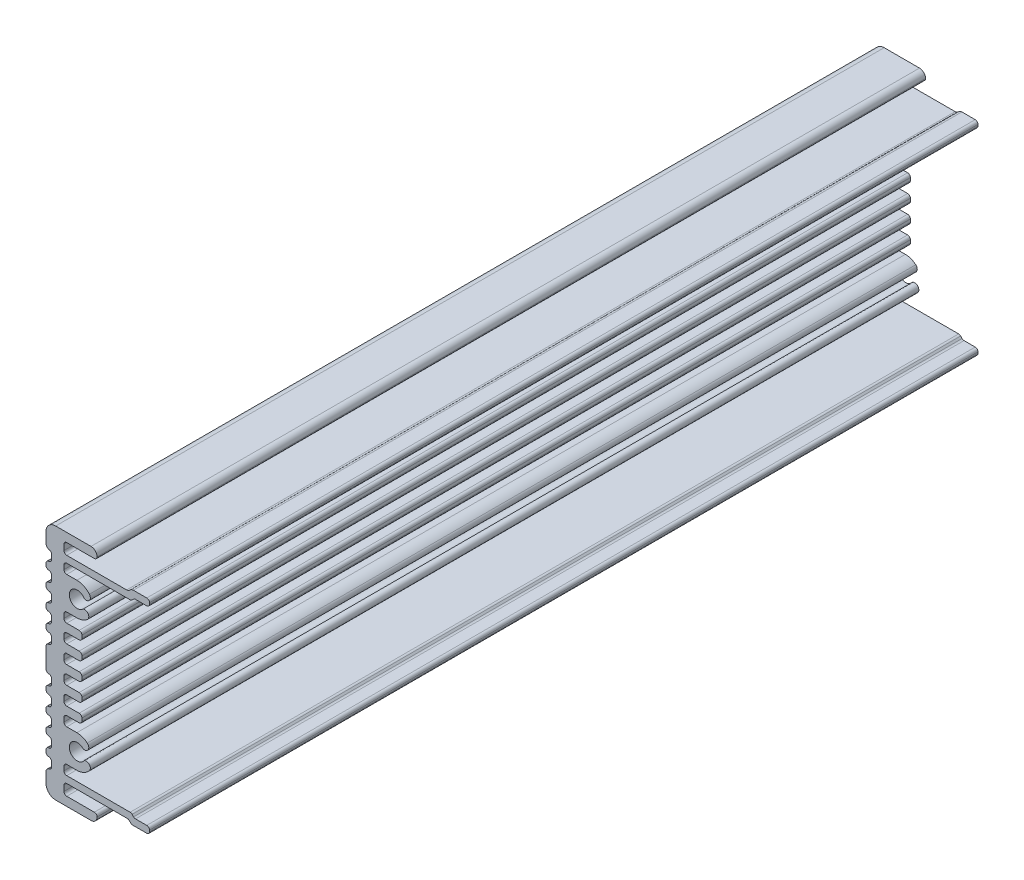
from build123d import *

# Parameters (mm, degrees)
BOSS_EXTRUDE1_DEPTH = 152.4
SKETCH2_R           = 1.473199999
CUT_EXTRUDE2_DEPTH  = 156.129259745
BOSS_EXTRUDE2_DEPTH = 152.4


with BuildPart() as part:
    # Model → Boss-Extrude1 (new body)
    with BuildSketch(Plane.XY):
        with BuildLine():
            Line((1.015999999, -16.954022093), (1.015999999, -16.069193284))
            ThreePointArc((1.015999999, -16.069193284), (0.88986555, -15.734166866), (0.574099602, -15.565511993))
            Line((0.574099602, -15.565511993), (0.441900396, -15.548163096))
            ThreePointArc((0.441900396, -15.548163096), (0.126134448, -15.379508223), (-1e-09, -15.044481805))
            Line((-1e-09, -15.044481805), (-1e-09, -14.673518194))
            ThreePointArc((-1e-09, -14.673518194), (0.126134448, -14.338491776), (0.441900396, -14.169836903))
            Line((0.441900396, -14.169836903), (0.574099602, -14.152488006))
            ThreePointArc((0.574099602, -14.152488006), (0.88986555, -13.983833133), (1.015999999, -13.648806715))
            Line((1.015999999, -13.648806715), (1.015999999, -12.767193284))
            ThreePointArc((1.015999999, -12.767193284), (0.88986555, -12.432166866), (0.574099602, -12.263511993))
            Line((0.574099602, -12.263511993), (0.441900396, -12.246163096))
            ThreePointArc((0.441900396, -12.246163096), (0.126134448, -12.077508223), (-1e-09, -11.742481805))
            Line((-1e-09, -11.742481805), (-1e-09, -11.371518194))
            ThreePointArc((-1e-09, -11.371518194), (0.126134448, -11.036491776), (0.441900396, -10.867836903))
            Line((0.441900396, -10.867836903), (0.574099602, -10.850488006))
            ThreePointArc((0.574099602, -10.850488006), (0.88986555, -10.681833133), (1.015999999, -10.346806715))
            Line((1.015999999, -10.346806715), (1.015999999, -9.465193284))
            ThreePointArc((1.015999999, -9.465193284), (0.88986555, -9.130166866), (0.574099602, -8.961511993))
            Line((0.574099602, -8.961511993), (0.441900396, -8.944163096))
            ThreePointArc((0.441900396, -8.944163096), (0.126134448, -8.775508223), (-1e-09, -8.440481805))
            Line((-1e-09, -8.440481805), (-1e-09, -8.069518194))
            ThreePointArc((-1e-09, -8.069518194), (0.126134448, -7.734491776), (0.441900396, -7.565836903))
            Line((0.441900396, -7.565836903), (0.574099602, -7.548488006))
            ThreePointArc((0.574099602, -7.548488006), (0.88986555, -7.379833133), (1.015999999, -7.044806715))
            Line((1.015999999, -7.044806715), (1.015999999, -6.163193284))
            ThreePointArc((1.015999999, -6.163193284), (0.88986555, -5.828166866), (0.574099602, -5.659511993))
            Line((0.574099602, -5.659511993), (0.441900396, -5.642163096))
            ThreePointArc((0.441900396, -5.642163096), (0.126134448, -5.473508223), (-1e-09, -5.138481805))
            Line((-1e-09, -5.138481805), (-1e-09, -4.767518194))
            ThreePointArc((-1e-09, -4.767518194), (0.126134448, -4.432491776), (0.441900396, -4.263836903))
            Line((0.441900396, -4.263836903), (0.574099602, -4.246488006))
            ThreePointArc((0.574099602, -4.246488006), (0.88986555, -4.077833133), (1.015999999, -3.742806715))
            Line((1.015999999, -3.742806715), (1.015999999, -2.861193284))
            ThreePointArc((1.015999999, -2.861193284), (0.88986555, -2.526166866), (0.574099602, -2.357511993))
            Line((0.574099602, -2.357511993), (0.441900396, -2.340163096))
            ThreePointArc((0.441900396, -2.340163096), (0.126134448, -2.171508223), (-1e-09, -1.836481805))
            Line((-1e-09, -1.836481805), (-1e-09, 1.836481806))
            ThreePointArc((-1e-09, 1.836481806), (0.126134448, 2.171508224), (0.441900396, 2.340163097))
            Line((0.441900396, 2.340163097), (0.574099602, 2.357511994))
            ThreePointArc((0.574099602, 2.357511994), (0.88986555, 2.526166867), (1.015999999, 2.861193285))
            Line((1.015999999, 2.861193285), (1.015999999, 3.742806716))
            ThreePointArc((1.015999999, 3.742806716), (0.88986555, 4.077833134), (0.574099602, 4.246488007))
            Line((0.574099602, 4.246488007), (0.441900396, 4.263836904))
            ThreePointArc((0.441900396, 4.263836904), (0.126134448, 4.432491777), (-1e-09, 4.767518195))
            Line((-1e-09, 4.767518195), (-1e-09, 5.138481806))
            ThreePointArc((-1e-09, 5.138481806), (0.126134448, 5.473508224), (0.441900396, 5.642163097))
            Line((0.441900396, 5.642163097), (0.574099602, 5.659511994))
            ThreePointArc((0.574099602, 5.659511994), (0.88986555, 5.828166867), (1.015999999, 6.163193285))
            Line((1.015999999, 6.163193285), (1.015999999, 7.044806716))
            ThreePointArc((1.015999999, 7.044806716), (0.88986555, 7.379833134), (0.574099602, 7.548488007))
            Line((0.574099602, 7.548488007), (0.441900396, 7.565836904))
            ThreePointArc((0.441900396, 7.565836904), (0.126134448, 7.734491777), (-1e-09, 8.069518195))
            Line((-1e-09, 8.069518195), (-1e-09, 8.440481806))
            ThreePointArc((-1e-09, 8.440481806), (0.126134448, 8.775508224), (0.441900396, 8.944163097))
            Line((0.441900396, 8.944163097), (0.574099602, 8.961511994))
            ThreePointArc((0.574099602, 8.961511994), (0.88986555, 9.130166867), (1.015999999, 9.465193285))
            Line((1.015999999, 9.465193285), (1.015999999, 10.346806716))
            ThreePointArc((1.015999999, 10.346806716), (0.88986555, 10.681833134), (0.574099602, 10.850488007))
            Line((0.574099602, 10.850488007), (0.441900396, 10.867836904))
            ThreePointArc((0.441900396, 10.867836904), (0.126134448, 11.036491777), (-1e-09, 11.371518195))
            Line((-1e-09, 11.371518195), (-1e-09, 11.742481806))
            ThreePointArc((-1e-09, 11.742481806), (0.126134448, 12.077508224), (0.441900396, 12.246163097))
            Line((0.441900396, 12.246163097), (0.574099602, 12.263511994))
            ThreePointArc((0.574099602, 12.263511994), (0.88986555, 12.432166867), (1.015999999, 12.767193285))
            Line((1.015999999, 12.767193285), (1.015999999, 13.648806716))
            ThreePointArc((1.015999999, 13.648806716), (0.88986555, 13.983833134), (0.574099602, 14.152488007))
            Line((0.574099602, 14.152488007), (0.441900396, 14.169836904))
            ThreePointArc((0.441900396, 14.169836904), (0.126134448, 14.338491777), (-1e-09, 14.673518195))
            Line((-1e-09, 14.673518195), (-1e-09, 15.044481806))
            ThreePointArc((-1e-09, 15.044481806), (0.126134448, 15.379508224), (0.441900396, 15.548163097))
            Line((0.441900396, 15.548163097), (0.574099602, 15.565511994))
            ThreePointArc((0.574099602, 15.565511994), (0.88986555, 15.734166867), (1.015999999, 16.069193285))
            Line((1.015999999, 16.069193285), (1.015999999, 16.954022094))
            ThreePointArc((1.015999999, 16.954022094), (0.901495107, 17.275309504), (0.6096, 17.451758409))
            ThreePointArc((0.6096, 17.451758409), (0.171757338, 17.716431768), (0, 18.198362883))
            Line((0, 18.198362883), (0, 20.055803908))
            ThreePointArc((0, 20.055803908), (0.520764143, 21.313039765), (1.778, 21.833803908))
            Line((1.778, 21.833803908), (8.2804, 21.833803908))
            ThreePointArc((8.2804, 21.833803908), (9.070662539, 21.506466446), (9.398, 20.716203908))
            ThreePointArc((9.398, 20.716203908), (9.249210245, 20.356993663), (8.89, 20.208203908))
            Line((8.89, 20.208203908), (3.81, 20.208203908))
            ThreePointArc((3.81, 20.208203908), (3.450789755, 20.059414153), (3.302, 19.700203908))
            Line((3.302, 19.700203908), (3.302, 18.684203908))
            ThreePointArc((3.302, 18.684203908), (3.450789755, 18.324993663), (3.81, 18.176203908))
            Line((3.81, 18.176203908), (14.834248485, 18.176203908))
            ThreePointArc((14.834248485, 18.176203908), (15.145293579, 18.238074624), (15.408984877, 18.414267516))
            Line((15.408984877, 18.414267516), (15.502316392, 18.507599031))
            ThreePointArc((15.502316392, 18.507599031), (15.76600769, 18.683791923), (16.077052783, 18.745662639))
            Line((16.077052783, 18.745662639), (18.53438, 18.745662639))
            ThreePointArc((18.53438, 18.745662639), (18.893590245, 18.596872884), (19.04238, 18.237662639))
            Line((19.04238, 18.237662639), (19.04238, 17.996461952))
            ThreePointArc((19.04238, 17.996461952), (18.893590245, 17.637251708), (18.53438, 17.488461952))
            Line((18.53438, 17.488461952), (16.471550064, 17.488461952))
            ThreePointArc((16.471550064, 17.488461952), (16.27714688, 17.449792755), (16.112339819, 17.339672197))
            Line((16.112339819, 17.339672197), (15.840460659, 17.067793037))
            ThreePointArc((15.840460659, 17.067793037), (15.675653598, 16.957672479), (15.481250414, 16.919003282))
            Line((15.481250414, 16.919003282), (3.81, 16.919003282))
            ThreePointArc((3.81, 16.919003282), (3.450789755, 16.770213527), (3.302, 16.411003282))
            Line((3.302, 16.411003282), (3.302, 15.649003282))
            ThreePointArc((3.302, 15.649003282), (3.450789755, 15.289793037), (3.81, 15.141003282))
            Line((3.81, 15.141003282), (5.678042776, 15.141003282))
            ThreePointArc((5.678042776, 15.141003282), (6.95053564, 14.857466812), (7.982271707, 14.060502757))
            ThreePointArc((7.982271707, 14.060502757), (7.883747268, 12.987385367), (6.810629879, 13.085909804))
            ThreePointArc((6.810629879, 13.085909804), (4.211012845, 12.278493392), (6.6201493, 11.011216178))
            ThreePointArc((6.6201493, 11.011216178), (7.693266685, 10.912691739), (7.594742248, 9.839574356))
            ThreePointArc((7.594742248, 9.839574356), (6.697104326, 9.32516507), (5.678042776, 9.146603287))
            Line((5.678042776, 9.146603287), (3.81, 9.146603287))
            ThreePointArc((3.81, 9.146603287), (3.450789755, 8.997813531), (3.302, 8.638603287))
            Line((3.302, 8.638603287), (3.302, 7.876503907))
            ThreePointArc((3.302, 7.876503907), (3.450789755, 7.517293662), (3.81, 7.368503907))
            Line((3.81, 7.368503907), (6.096, 7.368503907))
            ThreePointArc((6.096, 7.368503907), (6.455210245, 7.219714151), (6.604, 6.860503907))
            Line((6.604, 6.860503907), (6.604, 6.352503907))
            ThreePointArc((6.604, 6.352503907), (6.455210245, 5.993293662), (6.096, 5.844503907))
            Line((6.096, 5.844503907), (3.81, 5.844503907))
            ThreePointArc((3.81, 5.844503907), (3.450789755, 5.695714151), (3.302, 5.336503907))
            Line((3.302, 5.336503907), (3.302, 4.574503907))
            ThreePointArc((3.302, 4.574503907), (3.450789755, 4.215293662), (3.81, 4.066503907))
            Line((3.81, 4.066503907), (6.096, 4.066503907))
            ThreePointArc((6.096, 4.066503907), (6.455210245, 3.917714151), (6.604, 3.558503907))
            Line((6.604, 3.558503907), (6.604, 3.050503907))
            ThreePointArc((6.604, 3.050503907), (6.455210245, 2.691293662), (6.096, 2.542503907))
            Line((6.096, 2.542503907), (3.81, 2.542503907))
            ThreePointArc((3.81, 2.542503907), (3.450789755, 2.393714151), (3.302, 2.034503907))
            Line((3.302, 2.034503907), (3.302, 1.272503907))
            ThreePointArc((3.302, 1.272503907), (3.450789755, 0.913293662), (3.81, 0.764503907))
            Line((3.81, 0.764503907), (6.096, 0.764503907))
            ThreePointArc((6.096, 0.764503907), (6.455210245, 0.615714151), (6.604, 0.256503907))
            Line((6.604, 0.256503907), (6.604, -0.251496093))
            ThreePointArc((6.604, -0.251496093), (6.455210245, -0.610706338), (6.096, -0.759496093))
            Line((6.096, -0.759496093), (3.81, -0.759496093))
            ThreePointArc((3.81, -0.759496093), (3.450789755, -0.908285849), (3.302, -1.267496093))
            Line((3.302, -1.267496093), (3.302, -2.029496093))
            ThreePointArc((3.302, -2.029496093), (3.450789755, -2.388706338), (3.81, -2.537496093))
            Line((3.81, -2.537496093), (6.096, -2.537496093))
            ThreePointArc((6.096, -2.537496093), (6.455210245, -2.686285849), (6.604, -3.045496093))
            Line((6.604, -3.045496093), (6.604, -3.553496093))
            ThreePointArc((6.604, -3.553496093), (6.455210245, -3.912706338), (6.096, -4.061496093))
            Line((6.096, -4.061496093), (3.81, -4.061496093))
            ThreePointArc((3.81, -4.061496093), (3.450789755, -4.210285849), (3.302, -4.569496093))
            Line((3.302, -4.569496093), (3.302, -5.331496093))
            ThreePointArc((3.302, -5.331496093), (3.450789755, -5.690706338), (3.81, -5.839496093))
            Line((3.81, -5.839496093), (6.096, -5.839496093))
            ThreePointArc((6.096, -5.839496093), (6.455210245, -5.988285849), (6.604, -6.347496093))
            Line((6.604, -6.347496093), (6.604, -6.855496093))
            ThreePointArc((6.604, -6.855496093), (6.455210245, -7.214706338), (6.096, -7.363496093))
            Line((6.096, -7.363496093), (3.81, -7.363496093))
            ThreePointArc((3.81, -7.363496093), (3.450789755, -7.512285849), (3.302, -7.871496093))
            Line((3.302, -7.871496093), (3.302, -8.633595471))
            ThreePointArc((3.302, -8.633595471), (3.450789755, -8.992805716), (3.81, -9.141595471))
            Line((3.81, -9.141595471), (5.678042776, -9.141595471))
            ThreePointArc((5.678042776, -9.141595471), (6.697104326, -9.320157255), (7.594742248, -9.834566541))
            ThreePointArc((7.594742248, -9.834566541), (7.693266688, -10.907683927), (6.620149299, -11.006208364))
            ThreePointArc((6.620149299, -11.006208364), (4.211012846, -12.273485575), (6.810629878, -13.080901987))
            ThreePointArc((6.810629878, -13.080901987), (7.883747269, -12.982377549), (7.982271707, -14.055494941))
            ThreePointArc((7.982271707, -14.055494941), (6.95053564, -14.852458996), (5.678042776, -15.135995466))
            Line((5.678042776, -15.135995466), (3.81, -15.135995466))
            ThreePointArc((3.81, -15.135995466), (3.450789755, -15.284785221), (3.302, -15.643995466))
            Line((3.302, -15.643995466), (3.302, -16.405995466))
            ThreePointArc((3.302, -16.405995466), (3.450789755, -16.765205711), (3.81, -16.913995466))
            Line((3.81, -16.913995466), (15.481250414, -16.913995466))
            ThreePointArc((15.481250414, -16.913995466), (15.675653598, -16.952664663), (15.840460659, -17.062785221))
            Line((15.840460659, -17.062785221), (16.112339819, -17.334664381))
            ThreePointArc((16.112339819, -17.334664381), (16.27714688, -17.444784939), (16.471550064, -17.483454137))
            Line((16.471550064, -17.483454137), (18.53438, -17.483454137))
            ThreePointArc((18.53438, -17.483454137), (18.893590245, -17.632243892), (19.04238, -17.991454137))
            Line((19.04238, -17.991454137), (19.04238, -18.232654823))
            ThreePointArc((19.04238, -18.232654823), (18.893590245, -18.591865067), (18.53438, -18.740654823))
            Line((18.53438, -18.740654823), (15.950800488, -18.740654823))
            ThreePointArc((15.950800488, -18.740654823), (15.756397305, -18.701985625), (15.591590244, -18.591865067))
            Line((15.591590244, -18.591865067), (15.319711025, -18.319985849))
            ThreePointArc((15.319711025, -18.319985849), (15.154903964, -18.209865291), (14.96050078, -18.171196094))
            Line((14.96050078, -18.171196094), (3.81, -18.171196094))
            ThreePointArc((3.81, -18.171196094), (3.450789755, -18.319985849), (3.302, -18.679196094))
            Line((3.302, -18.679196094), (3.302, -19.695196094))
            ThreePointArc((3.302, -19.695196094), (3.450789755, -20.054406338), (3.81, -20.203196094))
            Line((3.81, -20.203196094), (8.89, -20.203196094))
            ThreePointArc((8.89, -20.203196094), (9.249210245, -20.351985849), (9.398, -20.711196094))
            ThreePointArc((9.398, -20.711196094), (9.070662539, -21.501458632), (8.2804, -21.828796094))
            Line((8.2804, -21.828796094), (1.778, -21.828796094))
            ThreePointArc((1.778, -21.828796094), (0.520764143, -21.308031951), (0, -20.050796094))
            Line((0, -20.050796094), (0, -18.198362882))
            ThreePointArc((0, -18.198362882), (0.171757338, -17.716431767), (0.6096, -17.451758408))
            ThreePointArc((0.6096, -17.451758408), (0.901495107, -17.275309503), (1.015999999, -16.954022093))
        make_face()
    extrude(amount=-BOSS_EXTRUDE1_DEPTH)

    # Sketch2 → Cut-Extrude2 (cut, through all)
    with BuildSketch(Plane.XY):
        with Locations((5.754242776, 12.143803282)):
            Circle(SKETCH2_R)
        with Locations((5.754242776, -12.138795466)):
            Circle(SKETCH2_R)
    extrude(amount=-CUT_EXTRUDE2_DEPTH, mode=Mode.SUBTRACT)

    # Sketch4 → Boss-Extrude2 (add)
    with BuildSketch(Plane.XY):
        with BuildLine():
            ThreePointArc((5.716142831, 13.616510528), (4.2810428, 12.143803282), (5.716142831, 10.671096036))
            ThreePointArc((5.716142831, 10.671096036), (4.204842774, 12.143803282), (5.716142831, 13.616510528))
        make_face()
        with BuildLine():
            ThreePointArc((5.716142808, -10.666088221), (4.281042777, -12.138795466), (5.716142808, -13.611502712))
            ThreePointArc((5.716142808, -13.611502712), (4.204842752, -12.138795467), (5.716142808, -10.666088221))
        make_face()
    extrude(amount=-BOSS_EXTRUDE2_DEPTH)


solid = part.part
